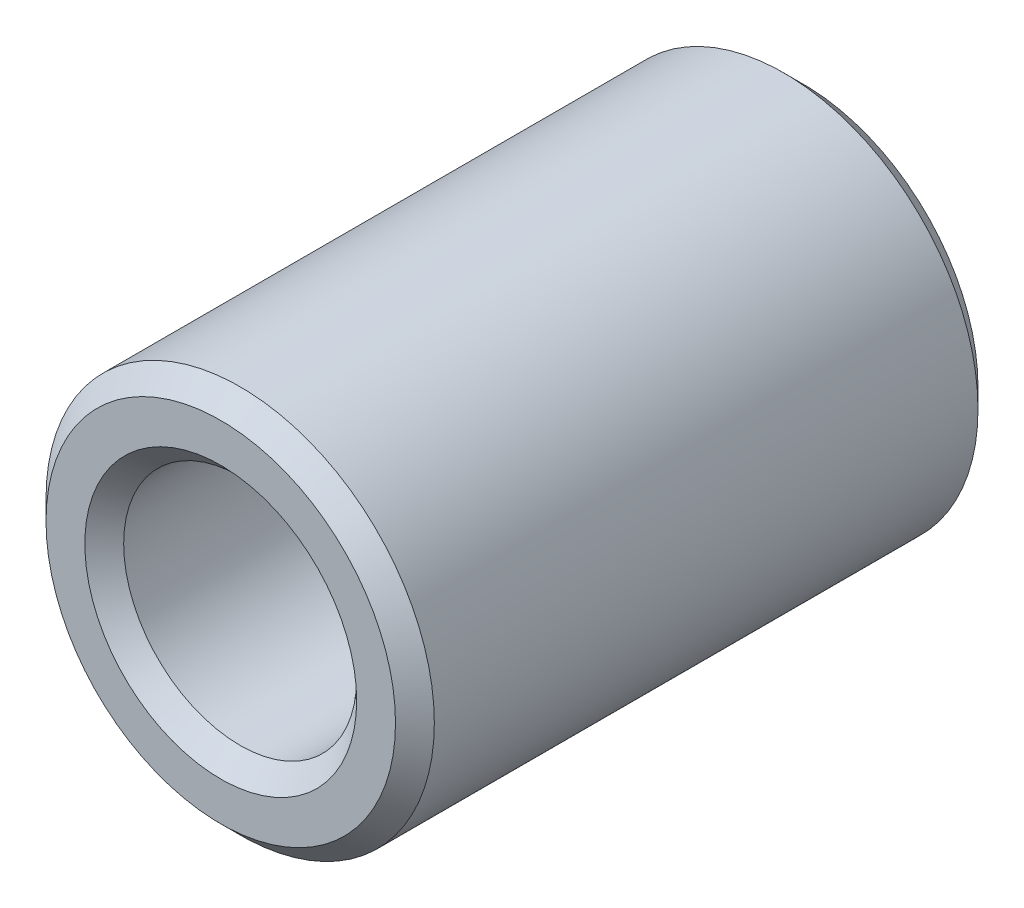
ISO-10303-21;
HEADER;
FILE_DESCRIPTION(('STEP AP214'),'2;1');
FILE_NAME('part.step','',(''),(''),'','','');
FILE_SCHEMA(('AUTOMOTIVE_DESIGN { 1 0 10303 214 1 1 1 1 }'));
ENDSEC;
DATA;
#1=APPLICATION_CONTEXT('core data for automotive mechanical design processes');
#2=APPLICATION_PROTOCOL_DEFINITION('international standard','automotive_design',2000,#1);
#3=PRODUCT_CONTEXT('',#1,'mechanical');
#4=PRODUCT('Part','Part','',(#3));
#5=PRODUCT_RELATED_PRODUCT_CATEGORY('part','',(#4));
#6=PRODUCT_DEFINITION_FORMATION('','',#4);
#7=PRODUCT_DEFINITION_CONTEXT('part definition',#1,'design');
#8=PRODUCT_DEFINITION('design','',#6,#7);
#9=PRODUCT_DEFINITION_SHAPE('','',#8);
#10=(LENGTH_UNIT() NAMED_UNIT(*) SI_UNIT(.MILLI.,.METRE.));
#11=(NAMED_UNIT(*) PLANE_ANGLE_UNIT() SI_UNIT($,.RADIAN.));
#12=(NAMED_UNIT(*) SI_UNIT($,.STERADIAN.) SOLID_ANGLE_UNIT());
#13=UNCERTAINTY_MEASURE_WITH_UNIT(LENGTH_MEASURE(1.E-05),#10,'distance_accuracy_value','');
#14=(GEOMETRIC_REPRESENTATION_CONTEXT(3) GLOBAL_UNCERTAINTY_ASSIGNED_CONTEXT((#13)) GLOBAL_UNIT_ASSIGNED_CONTEXT((#10,
#11,#12)) REPRESENTATION_CONTEXT('',''));
#15=CARTESIAN_POINT('',(0.,0.,0.));
#16=DIRECTION('',(0.,0.,1.));
#17=DIRECTION('',(1.,0.,0.));
#18=AXIS2_PLACEMENT_3D('',#15,#16,#17);
#19=CARTESIAN_POINT('',(0.,0.,-15.));
#20=DIRECTION('',(0.,0.,1.));
#21=DIRECTION('',(1.,0.,0.));
#22=AXIS2_PLACEMENT_3D('',#19,#20,#21);
#23=CYLINDRICAL_SURFACE('',#22,5.);
#24=CARTESIAN_POINT('',(0.,0.,-0.5));
#25=DIRECTION('',(0.,0.,1.));
#26=DIRECTION('',(1.,0.,0.));
#27=AXIS2_PLACEMENT_3D('',#24,#25,#26);
#28=CIRCLE('',#27,5.);
#29=CARTESIAN_POINT('',(5.,0.,-0.5));
#30=VERTEX_POINT('',#29);
#31=EDGE_CURVE('E49',#30,#30,#28,.F.);
#32=ORIENTED_EDGE('',*,*,#31,.T.);
#33=EDGE_LOOP('',(#32));
#34=FACE_BOUND('',#33,.T.);
#35=CARTESIAN_POINT('',(0.,0.,-14.5));
#36=DIRECTION('',(0.,0.,1.));
#37=DIRECTION('',(1.,0.,0.));
#38=AXIS2_PLACEMENT_3D('',#35,#36,#37);
#39=CIRCLE('',#38,5.);
#40=CARTESIAN_POINT('',(5.,0.,-14.5));
#41=VERTEX_POINT('',#40);
#42=EDGE_CURVE('E52',#41,#41,#39,.T.);
#43=ORIENTED_EDGE('',*,*,#42,.T.);
#44=EDGE_LOOP('',(#43));
#45=FACE_BOUND('',#44,.T.);
#46=ADVANCED_FACE('F30',(#34,#45),#23,.T.);
#47=CARTESIAN_POINT('',(0.,0.,-15.));
#48=DIRECTION('',(0.,0.,1.));
#49=DIRECTION('',(1.,0.,0.));
#50=AXIS2_PLACEMENT_3D('',#47,#48,#49);
#51=PLANE('',#50);
#52=CARTESIAN_POINT('',(0.,0.,-15.));
#53=DIRECTION('',(0.,0.,1.));
#54=DIRECTION('',(1.,0.,0.));
#55=AXIS2_PLACEMENT_3D('',#52,#53,#54);
#56=CIRCLE('',#55,4.49999999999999);
#57=CARTESIAN_POINT('',(4.49999999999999,0.,-15.));
#58=VERTEX_POINT('',#57);
#59=EDGE_CURVE('E40',#58,#58,#56,.F.);
#60=ORIENTED_EDGE('',*,*,#59,.T.);
#61=EDGE_LOOP('',(#60));
#62=FACE_BOUND('',#61,.T.);
#63=CARTESIAN_POINT('',(0.,0.,-15.));
#64=DIRECTION('',(0.,0.,1.));
#65=DIRECTION('',(1.,0.,0.));
#66=AXIS2_PLACEMENT_3D('',#63,#64,#65);
#67=CIRCLE('',#66,3.50000000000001);
#68=CARTESIAN_POINT('',(3.50000000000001,0.,-15.));
#69=VERTEX_POINT('',#68);
#70=EDGE_CURVE('E44',#69,#69,#67,.T.);
#71=ORIENTED_EDGE('',*,*,#70,.T.);
#72=EDGE_LOOP('',(#71));
#73=FACE_BOUND('',#72,.T.);
#74=ADVANCED_FACE('F80',(#62,#73),#51,.F.);
#75=CARTESIAN_POINT('',(0.,0.,0.));
#76=DIRECTION('',(0.,0.,1.));
#77=DIRECTION('',(1.,0.,0.));
#78=AXIS2_PLACEMENT_3D('',#75,#76,#77);
#79=PLANE('',#78);
#80=CARTESIAN_POINT('',(0.,0.,0.));
#81=DIRECTION('',(0.,0.,1.));
#82=DIRECTION('',(1.,0.,0.));
#83=AXIS2_PLACEMENT_3D('',#80,#81,#82);
#84=CIRCLE('',#83,4.49999999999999);
#85=CARTESIAN_POINT('',(4.49999999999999,0.,0.));
#86=VERTEX_POINT('',#85);
#87=EDGE_CURVE('E55',#86,#86,#84,.T.);
#88=ORIENTED_EDGE('',*,*,#87,.T.);
#89=EDGE_LOOP('',(#88));
#90=FACE_BOUND('',#89,.T.);
#91=CARTESIAN_POINT('',(0.,0.,0.));
#92=DIRECTION('',(0.,0.,1.));
#93=DIRECTION('',(1.,0.,0.));
#94=AXIS2_PLACEMENT_3D('',#91,#92,#93);
#95=CIRCLE('',#94,3.50000000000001);
#96=CARTESIAN_POINT('',(3.50000000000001,0.,0.));
#97=VERTEX_POINT('',#96);
#98=EDGE_CURVE('E58',#97,#97,#95,.F.);
#99=ORIENTED_EDGE('',*,*,#98,.T.);
#100=EDGE_LOOP('',(#99));
#101=FACE_BOUND('',#100,.T.);
#102=ADVANCED_FACE('F62',(#90,#101),#79,.T.);
#103=CARTESIAN_POINT('',(0.,0.,-15.));
#104=DIRECTION('',(0.,0.,1.));
#105=DIRECTION('',(1.,0.,0.));
#106=AXIS2_PLACEMENT_3D('',#103,#104,#105);
#107=CYLINDRICAL_SURFACE('',#106,3.);
#108=CARTESIAN_POINT('',(0.,0.,-0.5));
#109=DIRECTION('',(0.,0.,1.));
#110=DIRECTION('',(1.,0.,0.));
#111=AXIS2_PLACEMENT_3D('',#108,#109,#110);
#112=CIRCLE('',#111,3.);
#113=CARTESIAN_POINT('',(3.,0.,-0.5));
#114=VERTEX_POINT('',#113);
#115=EDGE_CURVE('E10',#114,#114,#112,.T.);
#116=ORIENTED_EDGE('',*,*,#115,.T.);
#117=EDGE_LOOP('',(#116));
#118=FACE_BOUND('',#117,.T.);
#119=CARTESIAN_POINT('',(0.,0.,-14.5));
#120=DIRECTION('',(0.,0.,1.));
#121=DIRECTION('',(1.,0.,0.));
#122=AXIS2_PLACEMENT_3D('',#119,#120,#121);
#123=CIRCLE('',#122,3.);
#124=CARTESIAN_POINT('',(3.,0.,-14.5));
#125=VERTEX_POINT('',#124);
#126=EDGE_CURVE('E36',#125,#125,#123,.F.);
#127=ORIENTED_EDGE('',*,*,#126,.T.);
#128=EDGE_LOOP('',(#127));
#129=FACE_BOUND('',#128,.T.);
#130=ADVANCED_FACE('F93',(#118,#129),#107,.F.);
#131=CARTESIAN_POINT('',(0.,0.,0.));
#132=DIRECTION('',(0.,0.,-1.));
#133=DIRECTION('',(-1.,0.,0.));
#134=AXIS2_PLACEMENT_3D('',#131,#132,#133);
#135=CONICAL_SURFACE('',#134,4.49999999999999,0.785398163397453);
#136=ORIENTED_EDGE('',*,*,#31,.F.);
#137=EDGE_LOOP('',(#136));
#138=FACE_BOUND('',#137,.T.);
#139=ORIENTED_EDGE('',*,*,#87,.F.);
#140=EDGE_LOOP('',(#139));
#141=FACE_BOUND('',#140,.T.);
#142=ADVANCED_FACE('F76',(#138,#141),#135,.T.);
#143=CARTESIAN_POINT('',(0.,0.,-14.5));
#144=DIRECTION('',(0.,0.,1.));
#145=DIRECTION('',(1.,0.,0.));
#146=AXIS2_PLACEMENT_3D('',#143,#144,#145);
#147=CONICAL_SURFACE('',#146,5.,0.785398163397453);
#148=ORIENTED_EDGE('',*,*,#59,.F.);
#149=EDGE_LOOP('',(#148));
#150=FACE_BOUND('',#149,.T.);
#151=ORIENTED_EDGE('',*,*,#42,.F.);
#152=EDGE_LOOP('',(#151));
#153=FACE_BOUND('',#152,.T.);
#154=ADVANCED_FACE('F68',(#150,#153),#147,.T.);
#155=CARTESIAN_POINT('',(0.,0.,-0.5));
#156=DIRECTION('',(0.,0.,1.));
#157=DIRECTION('',(1.,0.,0.));
#158=AXIS2_PLACEMENT_3D('',#155,#156,#157);
#159=CONICAL_SURFACE('',#158,3.,0.785398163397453);
#160=ORIENTED_EDGE('',*,*,#98,.F.);
#161=EDGE_LOOP('',(#160));
#162=FACE_BOUND('',#161,.T.);
#163=ORIENTED_EDGE('',*,*,#115,.F.);
#164=EDGE_LOOP('',(#163));
#165=FACE_BOUND('',#164,.T.);
#166=ADVANCED_FACE('F64',(#162,#165),#159,.F.);
#167=CARTESIAN_POINT('',(0.,0.,-15.));
#168=DIRECTION('',(0.,0.,-1.));
#169=DIRECTION('',(-1.,0.,0.));
#170=AXIS2_PLACEMENT_3D('',#167,#168,#169);
#171=CONICAL_SURFACE('',#170,3.50000000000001,0.785398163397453);
#172=ORIENTED_EDGE('',*,*,#126,.F.);
#173=EDGE_LOOP('',(#172));
#174=FACE_BOUND('',#173,.T.);
#175=ORIENTED_EDGE('',*,*,#70,.F.);
#176=EDGE_LOOP('',(#175));
#177=FACE_BOUND('',#176,.T.);
#178=ADVANCED_FACE('F67',(#174,#177),#171,.F.);
#179=CLOSED_SHELL('',(#46,#74,#102,#130,#142,#154,#166,#178));
#180=MANIFOLD_SOLID_BREP('B2',#179);
#181=ADVANCED_BREP_SHAPE_REPRESENTATION('',(#18,#180),#14);
#182=SHAPE_DEFINITION_REPRESENTATION(#9,#181);
ENDSEC;
END-ISO-10303-21;
